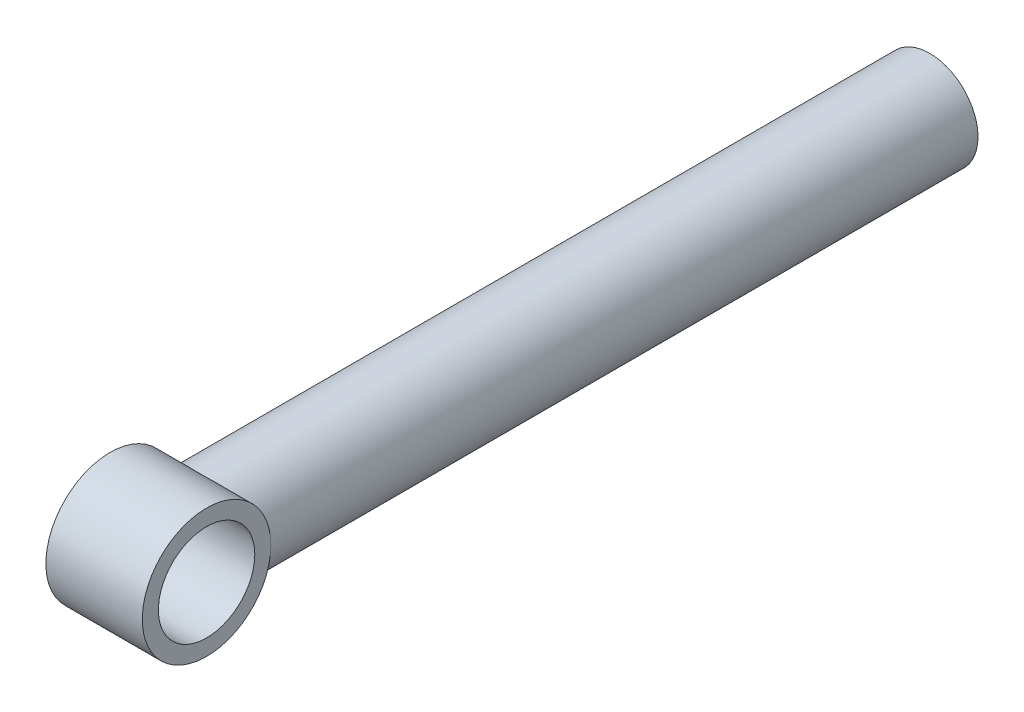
ISO-10303-21;
HEADER;
FILE_DESCRIPTION(('STEP AP214'),'2;1');
FILE_NAME('part.step','',(''),(''),'','','');
FILE_SCHEMA(('AUTOMOTIVE_DESIGN { 1 0 10303 214 1 1 1 1 }'));
ENDSEC;
DATA;
#1=APPLICATION_CONTEXT('core data for automotive mechanical design processes');
#2=APPLICATION_PROTOCOL_DEFINITION('international standard','automotive_design',2000,#1);
#3=PRODUCT_CONTEXT('',#1,'mechanical');
#4=PRODUCT('Part','Part','',(#3));
#5=PRODUCT_RELATED_PRODUCT_CATEGORY('part','',(#4));
#6=PRODUCT_DEFINITION_FORMATION('','',#4);
#7=PRODUCT_DEFINITION_CONTEXT('part definition',#1,'design');
#8=PRODUCT_DEFINITION('design','',#6,#7);
#9=PRODUCT_DEFINITION_SHAPE('','',#8);
#10=(LENGTH_UNIT() NAMED_UNIT(*) SI_UNIT(.MILLI.,.METRE.));
#11=(NAMED_UNIT(*) PLANE_ANGLE_UNIT() SI_UNIT($,.RADIAN.));
#12=(NAMED_UNIT(*) SI_UNIT($,.STERADIAN.) SOLID_ANGLE_UNIT());
#13=UNCERTAINTY_MEASURE_WITH_UNIT(LENGTH_MEASURE(1.E-05),#10,'distance_accuracy_value','');
#14=(GEOMETRIC_REPRESENTATION_CONTEXT(3) GLOBAL_UNCERTAINTY_ASSIGNED_CONTEXT((#13)) GLOBAL_UNIT_ASSIGNED_CONTEXT((#10,
#11,#12)) REPRESENTATION_CONTEXT('',''));
#15=CARTESIAN_POINT('',(0.,0.,0.));
#16=DIRECTION('',(0.,0.,1.));
#17=DIRECTION('',(1.,0.,0.));
#18=AXIS2_PLACEMENT_3D('',#15,#16,#17);
#19=CARTESIAN_POINT('',(0.,0.,240.));
#20=DIRECTION('',(0.,0.,-1.));
#21=DIRECTION('',(-1.,0.,0.));
#22=AXIS2_PLACEMENT_3D('',#19,#20,#21);
#23=CYLINDRICAL_SURFACE('',#22,15.);
#24=CARTESIAN_POINT('',(0.,0.,0.));
#25=DIRECTION('',(0.,0.,1.));
#26=DIRECTION('',(1.,0.,0.));
#27=AXIS2_PLACEMENT_3D('',#24,#25,#26);
#28=CIRCLE('',#27,15.);
#29=CARTESIAN_POINT('',(15.,0.,0.));
#30=VERTEX_POINT('',#29);
#31=EDGE_CURVE('E42',#30,#30,#28,.T.);
#32=ORIENTED_EDGE('',*,*,#31,.T.);
#33=EDGE_LOOP('',(#32));
#34=FACE_BOUND('',#33,.T.);
#35=CARTESIAN_POINT('',(-15.,0.,220.));
#36=CARTESIAN_POINT('',(-14.9999963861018,-0.36629671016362,220.000003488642));
#37=CARTESIAN_POINT('',(-14.98655812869,-0.732685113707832,220.010087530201));
#38=CARTESIAN_POINT('',(-14.9330150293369,-1.4625693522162,220.050197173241));
#39=CARTESIAN_POINT('',(-14.8928942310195,-1.82606332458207,220.080234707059));
#40=CARTESIAN_POINT('',(-14.7865351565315,-2.54789047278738,220.15962785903));
#41=CARTESIAN_POINT('',(-14.720239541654,-2.90621051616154,220.209025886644));
#42=CARTESIAN_POINT('',(-14.562596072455,-3.61418352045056,220.325996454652));
#43=CARTESIAN_POINT('',(-14.4712516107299,-3.96383764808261,220.393566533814));
#44=CARTESIAN_POINT('',(-14.2654563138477,-4.65019870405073,220.544964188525));
#45=CARTESIAN_POINT('',(-14.1511500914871,-4.98697169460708,220.628689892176));
#46=CARTESIAN_POINT('',(-13.9005244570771,-5.64804382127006,220.811013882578));
#47=CARTESIAN_POINT('',(-13.7642043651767,-5.97234257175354,220.909612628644));
#48=CARTESIAN_POINT('',(-13.4711075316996,-6.60691757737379,221.11984333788));
#49=CARTESIAN_POINT('',(-13.3143414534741,-6.91720102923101,221.231468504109));
#50=CARTESIAN_POINT('',(-12.9817062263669,-7.52294704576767,221.465956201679));
#51=CARTESIAN_POINT('',(-12.8058342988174,-7.81840744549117,221.588820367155));
#52=CARTESIAN_POINT('',(-12.4192221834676,-8.42035871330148,221.855696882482));
#53=CARTESIAN_POINT('',(-12.2067615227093,-8.72534255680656,222.000614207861));
#54=CARTESIAN_POINT('',(-11.7621319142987,-9.31605837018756,222.299135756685));
#55=CARTESIAN_POINT('',(-11.5299619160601,-9.60178931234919,222.452740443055));
#56=CARTESIAN_POINT('',(-11.0468196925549,-10.1539423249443,222.766358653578));
#57=CARTESIAN_POINT('',(-10.7958215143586,-10.4203367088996,222.926380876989));
#58=CARTESIAN_POINT('',(-10.2762707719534,-10.9330453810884,223.25006115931));
#59=CARTESIAN_POINT('',(-10.0077168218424,-11.1793580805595,223.413719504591));
#60=CARTESIAN_POINT('',(-9.3974101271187,-11.6995959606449,223.77535462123));
#61=CARTESIAN_POINT('',(-9.05187565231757,-11.9689544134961,223.973544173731));
#62=CARTESIAN_POINT('',(-8.33702812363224,-12.4774364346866,224.366165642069));
#63=CARTESIAN_POINT('',(-7.96770794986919,-12.7165508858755,224.560596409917));
#64=CARTESIAN_POINT('',(-7.20608110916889,-13.1630960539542,224.939504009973));
#65=CARTESIAN_POINT('',(-6.81379796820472,-13.3705584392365,225.12399067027));
#66=CARTESIAN_POINT('',(-6.00624867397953,-13.7522438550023,225.476118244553));
#67=CARTESIAN_POINT('',(-5.5909957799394,-13.9264858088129,225.643768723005));
#68=CARTESIAN_POINT('',(-4.88479643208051,-14.1854714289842,225.90059011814));
#69=CARTESIAN_POINT('',(-4.60016260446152,-14.2803956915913,225.996933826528));
#70=CARTESIAN_POINT('',(-4.02184719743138,-14.4539208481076,226.17611784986));
#71=CARTESIAN_POINT('',(-3.72816855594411,-14.5325269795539,226.258962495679));
#72=CARTESIAN_POINT('',(-3.13318756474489,-14.6722978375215,226.408306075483));
#73=CARTESIAN_POINT('',(-2.83190065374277,-14.7334952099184,226.47483557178));
#74=CARTESIAN_POINT('',(-2.22263797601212,-14.8376332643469,226.589159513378));
#75=CARTESIAN_POINT('',(-1.91466229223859,-14.8805741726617,226.636954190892));
#76=CARTESIAN_POINT('',(-1.29123468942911,-14.9476378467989,226.712008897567));
#77=CARTESIAN_POINT('',(-0.975740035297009,-14.9715836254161,226.739075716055));
#78=CARTESIAN_POINT('',(-0.342730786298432,-14.9994296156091,226.770579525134));
#79=CARTESIAN_POINT('',(-0.0252162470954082,-15.0033303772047,226.775017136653));
#80=CARTESIAN_POINT('',(0.609009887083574,-14.990988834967,226.761029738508));
#81=CARTESIAN_POINT('',(0.925721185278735,-14.9747399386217,226.742597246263));
#82=CARTESIAN_POINT('',(1.55542834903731,-14.9224822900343,226.68380489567));
#83=CARTESIAN_POINT('',(1.86842417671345,-14.8864733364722,226.643444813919));
#84=CARTESIAN_POINT('',(2.45502533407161,-14.8003740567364,226.548139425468));
#85=CARTESIAN_POINT('',(2.72925137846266,-14.7522110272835,226.495225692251));
#86=CARTESIAN_POINT('',(3.27166976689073,-14.6414778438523,226.375250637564));
#87=CARTESIAN_POINT('',(3.53985991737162,-14.5789025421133,226.308184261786));
#88=CARTESIAN_POINT('',(4.33419345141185,-14.3706061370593,226.088626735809));
#89=CARTESIAN_POINT('',(4.85004827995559,-14.2043223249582,225.91778622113));
#90=CARTESIAN_POINT('',(5.75640752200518,-13.8583376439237,225.578010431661));
#91=CARTESIAN_POINT('',(6.15233722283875,-13.6869339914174,225.414671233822));
#92=CARTESIAN_POINT('',(6.92314358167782,-13.3136549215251,225.073158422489));
#93=CARTESIAN_POINT('',(7.29800930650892,-13.1117638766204,224.894977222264));
#94=CARTESIAN_POINT('',(8.02693261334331,-12.6786637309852,224.529643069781));
#95=CARTESIAN_POINT('',(8.3809453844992,-12.4473946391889,224.342472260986));
#96=CARTESIAN_POINT('',(9.06700444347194,-11.9568887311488,223.964769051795));
#97=CARTESIAN_POINT('',(9.39905416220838,-11.6976562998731,223.774237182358));
#98=CARTESIAN_POINT('',(10.0487102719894,-11.1449480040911,223.389570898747));
#99=CARTESIAN_POINT('',(10.3657402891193,-10.8507727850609,223.195466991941));
#100=CARTESIAN_POINT('',(10.9749424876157,-10.2341805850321,222.812993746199));
#101=CARTESIAN_POINT('',(11.2671121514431,-9.91176075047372,222.624624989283));
#102=CARTESIAN_POINT('',(11.8243371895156,-9.23987019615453,222.258213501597));
#103=CARTESIAN_POINT('',(12.08943761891,-8.89044618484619,222.080153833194));
#104=CARTESIAN_POINT('',(12.5907609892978,-8.16498687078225,221.738190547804));
#105=CARTESIAN_POINT('',(12.8269913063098,-7.78895840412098,221.574283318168));
#106=CARTESIAN_POINT('',(13.2236212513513,-7.08967069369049,221.295763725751));
#107=CARTESIAN_POINT('',(13.3897279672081,-6.77094997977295,221.177857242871));
#108=CARTESIAN_POINT('',(13.7001617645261,-6.11849819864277,220.955770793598));
#109=CARTESIAN_POINT('',(13.8444933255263,-5.78477023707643,220.851588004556));
#110=CARTESIAN_POINT('',(14.1097181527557,-5.10385045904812,220.658959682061));
#111=CARTESIAN_POINT('',(14.2306201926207,-4.75666374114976,220.570508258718));
#112=CARTESIAN_POINT('',(14.4474519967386,-4.05061594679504,220.411139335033));
#113=CARTESIAN_POINT('',(14.543381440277,-3.69175472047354,220.340222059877));
#114=CARTESIAN_POINT('',(14.7093306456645,-2.96248007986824,220.217146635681));
#115=CARTESIAN_POINT('',(14.779184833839,-2.59200851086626,220.165108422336));
#116=CARTESIAN_POINT('',(14.8909502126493,-1.84455393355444,220.081691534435));
#117=CARTESIAN_POINT('',(14.932861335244,-1.4675709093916,220.050312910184));
#118=CARTESIAN_POINT('',(14.9879704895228,-0.710460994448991,220.009028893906));
#119=CARTESIAN_POINT('',(15.0011780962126,-0.330335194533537,219.999116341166));
#120=CARTESIAN_POINT('',(14.9986571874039,0.429748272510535,220.001007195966));
#121=CARTESIAN_POINT('',(14.9829309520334,0.809705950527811,220.012808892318));
#122=CARTESIAN_POINT('',(14.9258791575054,1.52792655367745,220.055538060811));
#123=CARTESIAN_POINT('',(14.8872913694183,1.86653464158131,220.084419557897));
#124=CARTESIAN_POINT('',(14.7875385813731,2.53851557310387,220.158876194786));
#125=CARTESIAN_POINT('',(14.7263753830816,2.87188883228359,220.20445000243));
#126=CARTESIAN_POINT('',(14.5823024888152,3.53134483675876,220.311393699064));
#127=CARTESIAN_POINT('',(14.4993898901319,3.85742660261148,220.372765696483));
#128=CARTESIAN_POINT('',(14.3128639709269,4.50044558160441,220.510153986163));
#129=CARTESIAN_POINT('',(14.2092496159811,4.81738233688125,220.586171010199));
#130=CARTESIAN_POINT('',(13.9784956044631,5.4515589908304,220.754432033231));
#131=CARTESIAN_POINT('',(13.8506564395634,5.7684171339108,220.84715289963));
#132=CARTESIAN_POINT('',(13.5753911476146,6.38937517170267,221.04526142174));
#133=CARTESIAN_POINT('',(13.4279647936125,6.6934749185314,221.150649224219));
#134=CARTESIAN_POINT('',(13.1148514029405,7.28790228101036,221.372409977));
#135=CARTESIAN_POINT('',(12.9491654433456,7.57823070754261,221.488782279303));
#136=CARTESIAN_POINT('',(12.6007388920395,8.14444045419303,221.730820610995));
#137=CARTESIAN_POINT('',(12.4179958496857,8.4203196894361,221.856487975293));
#138=CARTESIAN_POINT('',(12.0047157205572,9.0019127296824,222.137008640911));
#139=CARTESIAN_POINT('',(11.7712929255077,9.30491784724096,222.293231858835));
#140=CARTESIAN_POINT('',(11.2842239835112,9.88995490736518,222.613223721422));
#141=CARTESIAN_POINT('',(11.0305758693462,10.1719848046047,222.776993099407));
#142=CARTESIAN_POINT('',(10.503681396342,10.7152305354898,223.109604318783));
#143=CARTESIAN_POINT('',(10.2303950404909,10.9764014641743,223.278456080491));
#144=CARTESIAN_POINT('',(9.66554891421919,11.4769148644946,223.617940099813));
#145=CARTESIAN_POINT('',(9.37398804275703,11.716256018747,223.788572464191));
#146=CARTESIAN_POINT('',(8.71597382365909,12.2161163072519,224.160772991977));
#147=CARTESIAN_POINT('',(8.34582292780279,12.4720060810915,224.362052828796));
#148=CARTESIAN_POINT('',(7.58075412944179,12.9512931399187,224.756628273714));
#149=CARTESIAN_POINT('',(7.18582720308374,13.1746784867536,224.949920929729));
#150=CARTESIAN_POINT('',(6.37252076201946,13.5866966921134,225.320820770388));
#151=CARTESIAN_POINT('',(5.95419948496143,13.7754112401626,225.498464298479));
#152=CARTESIAN_POINT('',(5.09393731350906,14.1161407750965,225.829923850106));
#153=CARTESIAN_POINT('',(4.6520163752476,14.2681861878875,225.983759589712));
#154=CARTESIAN_POINT('',(3.92252673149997,14.4809148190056,226.204469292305));
#155=CARTESIAN_POINT('',(3.64175705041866,14.554134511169,226.28189796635));
#156=CARTESIAN_POINT('',(3.07294660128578,14.6847566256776,226.421815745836));
#157=CARTESIAN_POINT('',(2.78490843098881,14.7421646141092,226.484310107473));
#158=CARTESIAN_POINT('',(2.20334570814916,14.8402173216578,226.592044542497));
#159=CARTESIAN_POINT('',(1.90983235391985,14.8808930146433,226.637316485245));
#160=CARTESIAN_POINT('',(1.31859557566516,14.9448886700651,226.708926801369));
#161=CARTESIAN_POINT('',(1.02087214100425,14.9682085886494,226.735265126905));
#162=CARTESIAN_POINT('',(0.421908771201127,14.9970777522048,226.767912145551));
#163=CARTESIAN_POINT('',(0.120658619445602,15.0025347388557,226.77411685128));
#164=CARTESIAN_POINT('',(-0.481330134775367,14.9952971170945,226.765911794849));
#165=CARTESIAN_POINT('',(-0.78206874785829,14.9826028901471,226.751502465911));
#166=CARTESIAN_POINT('',(-1.3809393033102,14.9393187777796,226.702714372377));
#167=CARTESIAN_POINT('',(-1.67906797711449,14.9087090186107,226.668313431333));
#168=CARTESIAN_POINT('',(-2.27028883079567,14.8301978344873,226.581033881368));
#169=CARTESIAN_POINT('',(-2.56338030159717,14.7822939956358,226.528152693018));
#170=CARTESIAN_POINT('',(-3.20612627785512,14.6577625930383,226.392641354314));
#171=CARTESIAN_POINT('',(-3.55417107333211,14.5771485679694,226.30603797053));
#172=CARTESIAN_POINT('',(-4.238408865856,14.3931068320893,226.112731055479));
#173=CARTESIAN_POINT('',(-4.57459886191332,14.2896733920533,226.006022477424));
#174=CARTESIAN_POINT('',(-5.23472950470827,14.0612891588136,225.776555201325));
#175=CARTESIAN_POINT('',(-5.55864334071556,13.9362942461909,225.653763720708));
#176=CARTESIAN_POINT('',(-6.19301225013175,13.6662163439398,225.39625511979));
#177=CARTESIAN_POINT('',(-6.50346651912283,13.5211321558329,225.261537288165));
#178=CARTESIAN_POINT('',(-7.21617121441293,13.1581772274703,224.93544943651));
#179=CARTESIAN_POINT('',(-7.6128979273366,12.9325179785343,224.740641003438));
#180=CARTESIAN_POINT('',(-8.38146877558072,12.4481879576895,224.343024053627));
#181=CARTESIAN_POINT('',(-8.75330510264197,12.1895068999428,224.140213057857));
#182=CARTESIAN_POINT('',(-9.47179963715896,11.6400033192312,223.732626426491));
#183=CARTESIAN_POINT('',(-9.81843866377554,11.3491567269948,223.527849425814));
#184=CARTESIAN_POINT('',(-10.4851578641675,10.7362223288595,223.121947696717));
#185=CARTESIAN_POINT('',(-10.8052412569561,10.4141383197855,222.920822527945));
#186=CARTESIAN_POINT('',(-11.4198131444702,9.73646889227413,222.525551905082));
#187=CARTESIAN_POINT('',(-11.7140638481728,9.38062459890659,222.331479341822));
#188=CARTESIAN_POINT('',(-12.2715599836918,8.63852769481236,221.957035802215));
#189=CARTESIAN_POINT('',(-12.5348013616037,8.25227111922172,221.776666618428));
#190=CARTESIAN_POINT('',(-13.0267063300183,7.45152859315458,221.434874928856));
#191=CARTESIAN_POINT('',(-13.2554354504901,7.03709836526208,221.273416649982));
#192=CARTESIAN_POINT('',(-13.6752961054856,6.18166474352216,220.973910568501));
#193=CARTESIAN_POINT('',(-13.8664470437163,5.74067521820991,220.835850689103));
#194=CARTESIAN_POINT('',(-14.1574408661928,4.96827991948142,220.62407819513));
#195=CARTESIAN_POINT('',(-14.2676240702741,4.64264489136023,220.543366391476));
#196=CARTESIAN_POINT('',(-14.4660965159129,3.98135077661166,220.397361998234));
#197=CARTESIAN_POINT('',(-14.5543867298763,3.64569213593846,220.332068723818));
#198=CARTESIAN_POINT('',(-14.707704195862,2.96717677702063,220.218343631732));
#199=CARTESIAN_POINT('',(-14.7727874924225,2.62433954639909,220.169871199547));
#200=CARTESIAN_POINT('',(-14.879023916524,1.93308080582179,220.090602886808));
#201=CARTESIAN_POINT('',(-14.9201892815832,1.58466224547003,220.059797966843));
#202=CARTESIAN_POINT('',(-14.9660336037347,1.0296718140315,220.025464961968));
#203=CARTESIAN_POINT('',(-14.9787623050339,0.824089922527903,220.015924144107));
#204=CARTESIAN_POINT('',(-14.9957472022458,0.412348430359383,220.003190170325));
#205=CARTESIAN_POINT('',(-15.0000020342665,0.206188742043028,219.999998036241));
#206=CARTESIAN_POINT('',(-15.,0.,220.));
#207=B_SPLINE_CURVE_WITH_KNOTS('',3,(#35,#36,#37,#38,#39,#40,#41,#42,#43,#44,#45,#46,#47,#48,
#49,#50,#51,#52,#53,#54,#55,#56,#57,#58,#59,#60,#61,#62,#63,#64,#65,#66,#67,#68,#69,#70,#71,#72,
#73,#74,#75,#76,#77,#78,#79,#80,#81,#82,#83,#84,#85,#86,#87,#88,#89,#90,#91,#92,#93,#94,#95,#96,
#97,#98,#99,#100,#101,#102,#103,#104,#105,#106,#107,#108,#109,#110,#111,#112,#113,#114,#115,
#116,#117,#118,#119,#120,#121,#122,#123,#124,#125,#126,#127,#128,#129,#130,#131,#132,#133,#134,
#135,#136,#137,#138,#139,#140,#141,#142,#143,#144,#145,#146,#147,#148,#149,#150,#151,#152,#153,
#154,#155,#156,#157,#158,#159,#160,#161,#162,#163,#164,#165,#166,#167,#168,#169,#170,#171,#172,
#173,#174,#175,#176,#177,#178,#179,#180,#181,#182,#183,#184,#185,#186,#187,#188,#189,#190,#191,
#192,#193,#194,#195,#196,#197,#198,#199,#200,#201,#202,#203,#204,#205,#206),.UNSPECIFIED.,.T.,
.F.,(4,2,2,2,2,2,2,2,2,2,2,2,2,2,2,2,2,2,2,2,2,2,2,2,2,2,2,2,2,2,2,2,2,2,2,2,2,2,2,2,2,2,2,2,2,
2,2,2,2,2,2,2,2,2,2,2,2,2,2,2,2,2,2,2,2,2,2,2,2,2,2,2,2,2,2,2,2,2,2,2,2,2,2,2,2,4),(0.,
1.09866762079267,2.19799284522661,3.29973973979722,4.40133748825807,5.49620343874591,
6.59110320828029,7.68543421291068,8.7799245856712,9.97563800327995,11.1714151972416,
12.3688720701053,13.5664235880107,15.0074376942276,16.4488851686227,17.8888808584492,
19.3280538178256,20.2727344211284,21.217111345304,22.1597054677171,23.1022879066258,
24.0535529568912,25.0047919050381,25.9563421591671,26.9079021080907,27.757281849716,
28.6069654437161,30.3064901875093,31.6888011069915,33.0718230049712,34.4577159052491,
35.843391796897,37.2640550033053,38.6848619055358,40.1032640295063,41.5213030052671,
42.654991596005,43.7884466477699,44.92147643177,46.054520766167,47.1946420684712,
48.3347661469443,49.4745098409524,50.6141637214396,51.6390367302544,52.6638279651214,
53.6887560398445,54.713735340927,55.7747812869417,56.8358395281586,57.896835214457,
58.9579835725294,60.1962937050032,61.4347244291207,62.6757531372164,63.916856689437,
65.3940003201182,66.8716851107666,68.3458423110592,69.8187721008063,70.7189645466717,
71.6188396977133,72.5170414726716,73.4152455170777,74.3180813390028,75.2208981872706,
76.1247184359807,77.0286648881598,78.1298184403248,79.231248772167,80.3349601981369,
81.4387374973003,82.925485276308,84.4126972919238,85.9010298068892,87.3891816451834,
88.8898439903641,90.3907023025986,91.8886740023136,93.3858701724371,94.4441839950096,
95.5024508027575,96.5581443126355,97.613297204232,98.2316386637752,98.8500796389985),.UNSPECIFIED.);
#208=CARTESIAN_POINT('',(-15.,0.,220.));
#209=VERTEX_POINT('',#208);
#210=CARTESIAN_POINT('',(15.,0.,220.));
#211=VERTEX_POINT('',#210);
#212=EDGE_CURVE('E11',#209,#211,#207,.T.);
#213=ORIENTED_EDGE('',*,*,#212,.F.);
#214=EDGE_CURVE('E21',#211,#209,#207,.T.);
#215=ORIENTED_EDGE('',*,*,#214,.F.);
#216=EDGE_LOOP('',(#213,#215));
#217=FACE_BOUND('',#216,.T.);
#218=ADVANCED_FACE('F17',(#34,#217),#23,.T.);
#219=CARTESIAN_POINT('',(0.,0.,0.));
#220=DIRECTION('',(0.,0.,1.));
#221=DIRECTION('',(1.,0.,0.));
#222=AXIS2_PLACEMENT_3D('',#219,#220,#221);
#223=PLANE('',#222);
#224=ORIENTED_EDGE('',*,*,#31,.F.);
#225=EDGE_LOOP('',(#224));
#226=FACE_BOUND('',#225,.T.);
#227=ADVANCED_FACE('F71',(#226),#223,.F.);
#228=CARTESIAN_POINT('',(15.,0.,240.));
#229=DIRECTION('',(-1.,0.,0.));
#230=DIRECTION('',(0.,0.,1.));
#231=AXIS2_PLACEMENT_3D('',#228,#229,#230);
#232=CYLINDRICAL_SURFACE('',#231,20.);
#233=CARTESIAN_POINT('',(-15.,0.,240.));
#234=DIRECTION('',(1.,0.,0.));
#235=DIRECTION('',(0.,0.,-1.));
#236=AXIS2_PLACEMENT_3D('',#233,#234,#235);
#237=CIRCLE('',#236,20.);
#238=EDGE_CURVE('E40',#209,#209,#237,.T.);
#239=ORIENTED_EDGE('',*,*,#238,.T.);
#240=ORIENTED_EDGE('',*,*,#212,.T.);
#241=CARTESIAN_POINT('',(15.,0.,240.));
#242=DIRECTION('',(1.,0.,0.));
#243=DIRECTION('',(0.,0.,-1.));
#244=AXIS2_PLACEMENT_3D('',#241,#242,#243);
#245=CIRCLE('',#244,20.);
#246=EDGE_CURVE('E41',#211,#211,#245,.T.);
#247=ORIENTED_EDGE('',*,*,#246,.F.);
#248=ORIENTED_EDGE('',*,*,#214,.T.);
#249=EDGE_LOOP('',(#239,#240,#247,#248));
#250=FACE_BOUND('',#249,.T.);
#251=ADVANCED_FACE('F38',(#250),#232,.T.);
#252=CARTESIAN_POINT('',(15.,0.,240.));
#253=DIRECTION('',(1.,0.,0.));
#254=DIRECTION('',(0.,0.,-1.));
#255=AXIS2_PLACEMENT_3D('',#252,#253,#254);
#256=PLANE('',#255);
#257=CARTESIAN_POINT('',(15.,0.,240.));
#258=DIRECTION('',(1.,0.,0.));
#259=DIRECTION('',(0.,0.,-1.));
#260=AXIS2_PLACEMENT_3D('',#257,#258,#259);
#261=CIRCLE('',#260,15.);
#262=CARTESIAN_POINT('',(15.,0.,225.));
#263=VERTEX_POINT('',#262);
#264=EDGE_CURVE('E52',#263,#263,#261,.T.);
#265=ORIENTED_EDGE('',*,*,#264,.F.);
#266=EDGE_LOOP('',(#265));
#267=FACE_BOUND('',#266,.T.);
#268=ORIENTED_EDGE('',*,*,#246,.T.);
#269=EDGE_LOOP('',(#268));
#270=FACE_BOUND('',#269,.T.);
#271=ADVANCED_FACE('F58',(#267,#270),#256,.T.);
#272=CARTESIAN_POINT('',(-15.,0.,240.));
#273=DIRECTION('',(1.,0.,0.));
#274=DIRECTION('',(0.,0.,-1.));
#275=AXIS2_PLACEMENT_3D('',#272,#273,#274);
#276=PLANE('',#275);
#277=CARTESIAN_POINT('',(-15.,0.,240.));
#278=DIRECTION('',(1.,0.,0.));
#279=DIRECTION('',(0.,0.,-1.));
#280=AXIS2_PLACEMENT_3D('',#277,#278,#279);
#281=CIRCLE('',#280,15.);
#282=CARTESIAN_POINT('',(-15.,0.,225.));
#283=VERTEX_POINT('',#282);
#284=EDGE_CURVE('E49',#283,#283,#281,.T.);
#285=ORIENTED_EDGE('',*,*,#284,.T.);
#286=EDGE_LOOP('',(#285));
#287=FACE_BOUND('',#286,.T.);
#288=ORIENTED_EDGE('',*,*,#238,.F.);
#289=EDGE_LOOP('',(#288));
#290=FACE_BOUND('',#289,.T.);
#291=ADVANCED_FACE('F61',(#287,#290),#276,.F.);
#292=CARTESIAN_POINT('',(-15.,0.,240.));
#293=DIRECTION('',(1.,0.,0.));
#294=DIRECTION('',(0.,0.,-1.));
#295=AXIS2_PLACEMENT_3D('',#292,#293,#294);
#296=CYLINDRICAL_SURFACE('',#295,15.);
#297=ORIENTED_EDGE('',*,*,#284,.F.);
#298=EDGE_LOOP('',(#297));
#299=FACE_BOUND('',#298,.T.);
#300=ORIENTED_EDGE('',*,*,#264,.T.);
#301=EDGE_LOOP('',(#300));
#302=FACE_BOUND('',#301,.T.);
#303=ADVANCED_FACE('F56',(#299,#302),#296,.F.);
#304=CLOSED_SHELL('',(#218,#227,#251,#271,#291,#303));
#305=MANIFOLD_SOLID_BREP('B1',#304);
#306=ADVANCED_BREP_SHAPE_REPRESENTATION('',(#18,#305),#14);
#307=SHAPE_DEFINITION_REPRESENTATION(#9,#306);
ENDSEC;
END-ISO-10303-21;
